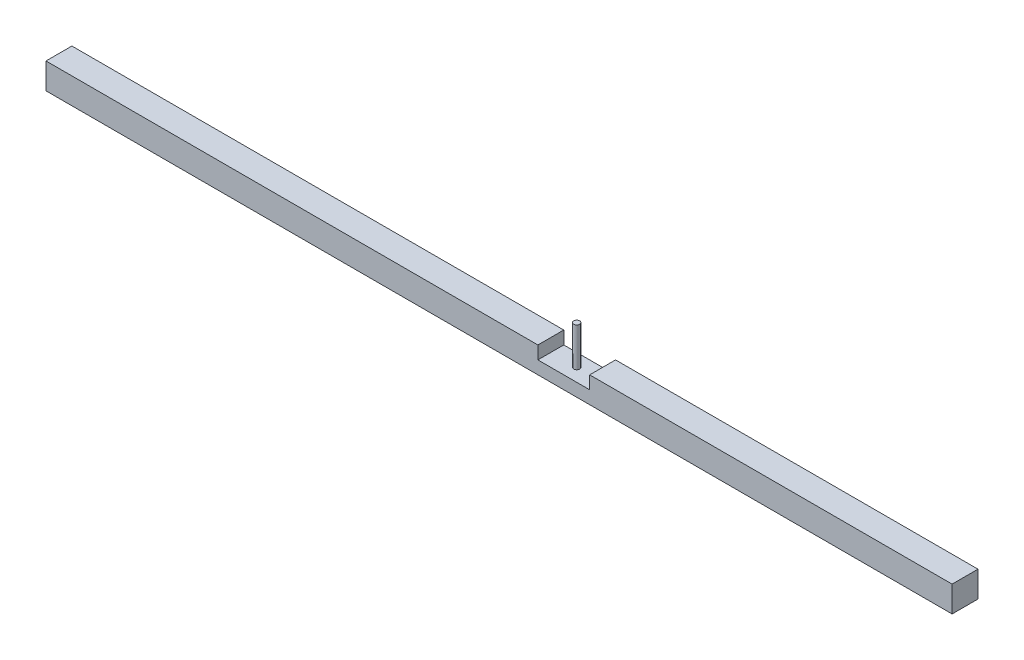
ISO-10303-21;
HEADER;
FILE_DESCRIPTION(('STEP AP214'),'2;1');
FILE_NAME('part.step','',(''),(''),'','','');
FILE_SCHEMA(('AUTOMOTIVE_DESIGN { 1 0 10303 214 1 1 1 1 }'));
ENDSEC;
DATA;
#1=APPLICATION_CONTEXT('core data for automotive mechanical design processes');
#2=APPLICATION_PROTOCOL_DEFINITION('international standard','automotive_design',2000,#1);
#3=PRODUCT_CONTEXT('',#1,'mechanical');
#4=PRODUCT('Part','Part','',(#3));
#5=PRODUCT_RELATED_PRODUCT_CATEGORY('part','',(#4));
#6=PRODUCT_DEFINITION_FORMATION('','',#4);
#7=PRODUCT_DEFINITION_CONTEXT('part definition',#1,'design');
#8=PRODUCT_DEFINITION('design','',#6,#7);
#9=PRODUCT_DEFINITION_SHAPE('','',#8);
#10=(LENGTH_UNIT() NAMED_UNIT(*) SI_UNIT(.MILLI.,.METRE.));
#11=(NAMED_UNIT(*) PLANE_ANGLE_UNIT() SI_UNIT($,.RADIAN.));
#12=(NAMED_UNIT(*) SI_UNIT($,.STERADIAN.) SOLID_ANGLE_UNIT());
#13=UNCERTAINTY_MEASURE_WITH_UNIT(LENGTH_MEASURE(1.E-05),#10,'distance_accuracy_value','');
#14=(GEOMETRIC_REPRESENTATION_CONTEXT(3) GLOBAL_UNCERTAINTY_ASSIGNED_CONTEXT((#13)) GLOBAL_UNIT_ASSIGNED_CONTEXT((#10,
#11,#12)) REPRESENTATION_CONTEXT('',''));
#15=CARTESIAN_POINT('',(0.,0.,0.));
#16=DIRECTION('',(0.,0.,1.));
#17=DIRECTION('',(1.,0.,0.));
#18=AXIS2_PLACEMENT_3D('',#15,#16,#17);
#19=CARTESIAN_POINT('',(25.4,0.,-12.7));
#20=DIRECTION('',(0.,-1.,0.));
#21=DIRECTION('',(0.,0.,-1.));
#22=AXIS2_PLACEMENT_3D('',#19,#20,#21);
#23=PLANE('',#22);
#24=DIRECTION('',(1.,0.,0.));
#25=VECTOR('',#24,1.);
#26=CARTESIAN_POINT('',(25.4,0.,12.7));
#27=LINE('',#26,#25);
#28=CARTESIAN_POINT('',(-25.4,0.,12.7));
#29=VERTEX_POINT('',#28);
#30=CARTESIAN_POINT('',(25.4,0.,12.7));
#31=VERTEX_POINT('',#30);
#32=EDGE_CURVE('E172',#29,#31,#27,.T.);
#33=ORIENTED_EDGE('',*,*,#32,.T.);
#34=DIRECTION('',(0.,0.,1.));
#35=VECTOR('',#34,1.);
#36=CARTESIAN_POINT('',(25.4,0.,-12.7));
#37=LINE('',#36,#35);
#38=CARTESIAN_POINT('',(25.4,0.,-12.7));
#39=VERTEX_POINT('',#38);
#40=EDGE_CURVE('E150',#39,#31,#37,.T.);
#41=ORIENTED_EDGE('',*,*,#40,.F.);
#42=DIRECTION('',(1.,0.,0.));
#43=VECTOR('',#42,1.);
#44=CARTESIAN_POINT('',(25.4,0.,-12.7));
#45=LINE('',#44,#43);
#46=CARTESIAN_POINT('',(-25.4,0.,-12.7));
#47=VERTEX_POINT('',#46);
#48=EDGE_CURVE('E46',#47,#39,#45,.T.);
#49=ORIENTED_EDGE('',*,*,#48,.F.);
#50=DIRECTION('',(0.,0.,1.));
#51=VECTOR('',#50,1.);
#52=CARTESIAN_POINT('',(-25.4,0.,-12.7));
#53=LINE('',#52,#51);
#54=EDGE_CURVE('E102',#47,#29,#53,.T.);
#55=ORIENTED_EDGE('',*,*,#54,.T.);
#56=EDGE_LOOP('',(#33,#41,#49,#55));
#57=FACE_BOUND('',#56,.T.);
#58=CARTESIAN_POINT('',(0.,0.,0.));
#59=DIRECTION('',(0.,-1.,0.));
#60=DIRECTION('',(0.,0.,-1.));
#61=AXIS2_PLACEMENT_3D('',#58,#59,#60);
#62=CIRCLE('',#61,2.921);
#63=CARTESIAN_POINT('',(0.,0.,-2.921));
#64=VERTEX_POINT('',#63);
#65=EDGE_CURVE('E11',#64,#64,#62,.F.);
#66=ORIENTED_EDGE('',*,*,#65,.F.);
#67=EDGE_LOOP('',(#66));
#68=FACE_BOUND('',#67,.T.);
#69=ADVANCED_FACE('F31',(#57,#68),#23,.F.);
#70=CARTESIAN_POINT('',(381.,12.7,12.7));
#71=DIRECTION('',(0.,-1.,0.));
#72=DIRECTION('',(0.,0.,-1.));
#73=AXIS2_PLACEMENT_3D('',#70,#71,#72);
#74=PLANE('',#73);
#75=DIRECTION('',(-1.,0.,0.));
#76=VECTOR('',#75,1.);
#77=CARTESIAN_POINT('',(381.,12.7,-12.7));
#78=LINE('',#77,#76);
#79=CARTESIAN_POINT('',(381.,12.7,-12.7));
#80=VERTEX_POINT('',#79);
#81=CARTESIAN_POINT('',(25.4,12.7,-12.7));
#82=VERTEX_POINT('',#81);
#83=EDGE_CURVE('E119',#80,#82,#78,.T.);
#84=ORIENTED_EDGE('',*,*,#83,.T.);
#85=DIRECTION('',(0.,0.,1.));
#86=VECTOR('',#85,1.);
#87=CARTESIAN_POINT('',(25.4,12.7,-12.7));
#88=LINE('',#87,#86);
#89=CARTESIAN_POINT('',(25.4,12.7,12.7));
#90=VERTEX_POINT('',#89);
#91=EDGE_CURVE('E147',#82,#90,#88,.T.);
#92=ORIENTED_EDGE('',*,*,#91,.T.);
#93=DIRECTION('',(-1.,0.,0.));
#94=VECTOR('',#93,1.);
#95=CARTESIAN_POINT('',(381.,12.7,12.7));
#96=LINE('',#95,#94);
#97=CARTESIAN_POINT('',(381.,12.7,12.7));
#98=VERTEX_POINT('',#97);
#99=EDGE_CURVE('E39',#98,#90,#96,.T.);
#100=ORIENTED_EDGE('',*,*,#99,.F.);
#101=DIRECTION('',(0.,0.,1.));
#102=VECTOR('',#101,1.);
#103=CARTESIAN_POINT('',(381.,12.7,12.7));
#104=LINE('',#103,#102);
#105=EDGE_CURVE('E156',#80,#98,#104,.T.);
#106=ORIENTED_EDGE('',*,*,#105,.F.);
#107=EDGE_LOOP('',(#84,#92,#100,#106));
#108=FACE_BOUND('',#107,.T.);
#109=ADVANCED_FACE('F168',(#108),#74,.F.);
#110=CARTESIAN_POINT('',(-25.4,12.7,12.7));
#111=VERTEX_POINT('',#110);
#112=CARTESIAN_POINT('',(-508.,12.7,12.7));
#113=VERTEX_POINT('',#112);
#114=EDGE_CURVE('E112',#111,#113,#96,.T.);
#115=ORIENTED_EDGE('',*,*,#114,.F.);
#116=DIRECTION('',(0.,0.,1.));
#117=VECTOR('',#116,1.);
#118=CARTESIAN_POINT('',(-25.4,12.7,-12.7));
#119=LINE('',#118,#117);
#120=CARTESIAN_POINT('',(-25.4,12.7,-12.7));
#121=VERTEX_POINT('',#120);
#122=EDGE_CURVE('E100',#121,#111,#119,.T.);
#123=ORIENTED_EDGE('',*,*,#122,.F.);
#124=CARTESIAN_POINT('',(-508.,12.7,-12.7));
#125=VERTEX_POINT('',#124);
#126=EDGE_CURVE('E110',#121,#125,#78,.T.);
#127=ORIENTED_EDGE('',*,*,#126,.T.);
#128=DIRECTION('',(0.,0.,1.));
#129=VECTOR('',#128,1.);
#130=CARTESIAN_POINT('',(-508.,12.7,12.7));
#131=LINE('',#130,#129);
#132=EDGE_CURVE('E143',#125,#113,#131,.T.);
#133=ORIENTED_EDGE('',*,*,#132,.T.);
#134=EDGE_LOOP('',(#115,#123,#127,#133));
#135=FACE_BOUND('',#134,.T.);
#136=ADVANCED_FACE('F33',(#135),#74,.F.);
#137=CARTESIAN_POINT('',(381.,-12.7,12.7));
#138=DIRECTION('',(0.,0.,-1.));
#139=DIRECTION('',(-1.,0.,0.));
#140=AXIS2_PLACEMENT_3D('',#137,#138,#139);
#141=PLANE('',#140);
#142=ORIENTED_EDGE('',*,*,#99,.T.);
#143=DIRECTION('',(0.,1.,0.));
#144=VECTOR('',#143,1.);
#145=CARTESIAN_POINT('',(25.4,12.7,12.7));
#146=LINE('',#145,#144);
#147=EDGE_CURVE('E105',#31,#90,#146,.T.);
#148=ORIENTED_EDGE('',*,*,#147,.F.);
#149=ORIENTED_EDGE('',*,*,#32,.F.);
#150=DIRECTION('',(0.,-1.,0.));
#151=VECTOR('',#150,1.);
#152=CARTESIAN_POINT('',(-25.4,0.,12.7));
#153=LINE('',#152,#151);
#154=EDGE_CURVE('E139',#111,#29,#153,.T.);
#155=ORIENTED_EDGE('',*,*,#154,.F.);
#156=ORIENTED_EDGE('',*,*,#114,.T.);
#157=DIRECTION('',(0.,-1.,0.));
#158=VECTOR('',#157,1.);
#159=CARTESIAN_POINT('',(-508.,-12.7,12.7));
#160=LINE('',#159,#158);
#161=CARTESIAN_POINT('',(-508.,-12.7,12.7));
#162=VERTEX_POINT('',#161);
#163=EDGE_CURVE('E137',#113,#162,#160,.T.);
#164=ORIENTED_EDGE('',*,*,#163,.T.);
#165=DIRECTION('',(-1.,0.,0.));
#166=VECTOR('',#165,1.);
#167=CARTESIAN_POINT('',(381.,-12.7,12.7));
#168=LINE('',#167,#166);
#169=CARTESIAN_POINT('',(381.,-12.7,12.7));
#170=VERTEX_POINT('',#169);
#171=EDGE_CURVE('E128',#170,#162,#168,.T.);
#172=ORIENTED_EDGE('',*,*,#171,.F.);
#173=DIRECTION('',(0.,-1.,0.));
#174=VECTOR('',#173,1.);
#175=CARTESIAN_POINT('',(381.,-12.7,12.7));
#176=LINE('',#175,#174);
#177=EDGE_CURVE('E158',#98,#170,#176,.T.);
#178=ORIENTED_EDGE('',*,*,#177,.F.);
#179=EDGE_LOOP('',(#142,#148,#149,#155,#156,#164,#172,#178));
#180=FACE_BOUND('',#179,.T.);
#181=ADVANCED_FACE('F135',(#180),#141,.F.);
#182=CARTESIAN_POINT('',(381.,-12.7,-12.7));
#183=DIRECTION('',(0.,1.,0.));
#184=DIRECTION('',(0.,0.,1.));
#185=AXIS2_PLACEMENT_3D('',#182,#183,#184);
#186=PLANE('',#185);
#187=ORIENTED_EDGE('',*,*,#171,.T.);
#188=DIRECTION('',(0.,0.,-1.));
#189=VECTOR('',#188,1.);
#190=CARTESIAN_POINT('',(-508.,-12.7,-12.7));
#191=LINE('',#190,#189);
#192=CARTESIAN_POINT('',(-508.,-12.7,-12.7));
#193=VERTEX_POINT('',#192);
#194=EDGE_CURVE('E145',#162,#193,#191,.T.);
#195=ORIENTED_EDGE('',*,*,#194,.T.);
#196=DIRECTION('',(-1.,0.,0.));
#197=VECTOR('',#196,1.);
#198=CARTESIAN_POINT('',(381.,-12.7,-12.7));
#199=LINE('',#198,#197);
#200=CARTESIAN_POINT('',(381.,-12.7,-12.7));
#201=VERTEX_POINT('',#200);
#202=EDGE_CURVE('E122',#201,#193,#199,.T.);
#203=ORIENTED_EDGE('',*,*,#202,.F.);
#204=DIRECTION('',(0.,0.,-1.));
#205=VECTOR('',#204,1.);
#206=CARTESIAN_POINT('',(381.,-12.7,-12.7));
#207=LINE('',#206,#205);
#208=EDGE_CURVE('E123',#170,#201,#207,.T.);
#209=ORIENTED_EDGE('',*,*,#208,.F.);
#210=EDGE_LOOP('',(#187,#195,#203,#209));
#211=FACE_BOUND('',#210,.T.);
#212=ADVANCED_FACE('F163',(#211),#186,.F.);
#213=CARTESIAN_POINT('',(381.,12.7,-12.7));
#214=DIRECTION('',(0.,0.,1.));
#215=DIRECTION('',(1.,0.,0.));
#216=AXIS2_PLACEMENT_3D('',#213,#214,#215);
#217=PLANE('',#216);
#218=ORIENTED_EDGE('',*,*,#48,.T.);
#219=DIRECTION('',(0.,1.,0.));
#220=VECTOR('',#219,1.);
#221=CARTESIAN_POINT('',(25.4,12.7,-12.7));
#222=LINE('',#221,#220);
#223=EDGE_CURVE('E113',#39,#82,#222,.T.);
#224=ORIENTED_EDGE('',*,*,#223,.T.);
#225=ORIENTED_EDGE('',*,*,#83,.F.);
#226=DIRECTION('',(0.,1.,0.));
#227=VECTOR('',#226,1.);
#228=CARTESIAN_POINT('',(381.,12.7,-12.7));
#229=LINE('',#228,#227);
#230=EDGE_CURVE('E54',#201,#80,#229,.T.);
#231=ORIENTED_EDGE('',*,*,#230,.F.);
#232=ORIENTED_EDGE('',*,*,#202,.T.);
#233=DIRECTION('',(0.,1.,0.));
#234=VECTOR('',#233,1.);
#235=CARTESIAN_POINT('',(-508.,12.7,-12.7));
#236=LINE('',#235,#234);
#237=EDGE_CURVE('E118',#193,#125,#236,.T.);
#238=ORIENTED_EDGE('',*,*,#237,.T.);
#239=ORIENTED_EDGE('',*,*,#126,.F.);
#240=DIRECTION('',(0.,-1.,0.));
#241=VECTOR('',#240,1.);
#242=CARTESIAN_POINT('',(-25.4,0.,-12.7));
#243=LINE('',#242,#241);
#244=EDGE_CURVE('E96',#121,#47,#243,.T.);
#245=ORIENTED_EDGE('',*,*,#244,.T.);
#246=EDGE_LOOP('',(#218,#224,#225,#231,#232,#238,#239,#245));
#247=FACE_BOUND('',#246,.T.);
#248=ADVANCED_FACE('F116',(#247),#217,.F.);
#249=CARTESIAN_POINT('',(381.,12.7,-12.7));
#250=DIRECTION('',(-1.,0.,0.));
#251=DIRECTION('',(0.,0.,1.));
#252=AXIS2_PLACEMENT_3D('',#249,#250,#251);
#253=PLANE('',#252);
#254=ORIENTED_EDGE('',*,*,#105,.T.);
#255=ORIENTED_EDGE('',*,*,#177,.T.);
#256=ORIENTED_EDGE('',*,*,#208,.T.);
#257=ORIENTED_EDGE('',*,*,#230,.T.);
#258=EDGE_LOOP('',(#254,#255,#256,#257));
#259=FACE_BOUND('',#258,.T.);
#260=ADVANCED_FACE('F161',(#259),#253,.F.);
#261=CARTESIAN_POINT('',(-508.,12.7,-12.7));
#262=DIRECTION('',(-1.,0.,0.));
#263=DIRECTION('',(0.,0.,1.));
#264=AXIS2_PLACEMENT_3D('',#261,#262,#263);
#265=PLANE('',#264);
#266=ORIENTED_EDGE('',*,*,#132,.F.);
#267=ORIENTED_EDGE('',*,*,#237,.F.);
#268=ORIENTED_EDGE('',*,*,#194,.F.);
#269=ORIENTED_EDGE('',*,*,#163,.F.);
#270=EDGE_LOOP('',(#266,#267,#268,#269));
#271=FACE_BOUND('',#270,.T.);
#272=ADVANCED_FACE('F142',(#271),#265,.T.);
#273=CARTESIAN_POINT('',(25.4,12.7,-12.7));
#274=DIRECTION('',(1.,0.,0.));
#275=DIRECTION('',(0.,0.,-1.));
#276=AXIS2_PLACEMENT_3D('',#273,#274,#275);
#277=PLANE('',#276);
#278=ORIENTED_EDGE('',*,*,#147,.T.);
#279=ORIENTED_EDGE('',*,*,#91,.F.);
#280=ORIENTED_EDGE('',*,*,#223,.F.);
#281=ORIENTED_EDGE('',*,*,#40,.T.);
#282=EDGE_LOOP('',(#278,#279,#280,#281));
#283=FACE_BOUND('',#282,.T.);
#284=ADVANCED_FACE('F170',(#283),#277,.F.);
#285=CARTESIAN_POINT('',(-25.4,0.,-12.7));
#286=DIRECTION('',(-1.,0.,0.));
#287=DIRECTION('',(0.,0.,1.));
#288=AXIS2_PLACEMENT_3D('',#285,#286,#287);
#289=PLANE('',#288);
#290=ORIENTED_EDGE('',*,*,#154,.T.);
#291=ORIENTED_EDGE('',*,*,#54,.F.);
#292=ORIENTED_EDGE('',*,*,#244,.F.);
#293=ORIENTED_EDGE('',*,*,#122,.T.);
#294=EDGE_LOOP('',(#290,#291,#292,#293));
#295=FACE_BOUND('',#294,.T.);
#296=ADVANCED_FACE('F99',(#295),#289,.F.);
#297=CARTESIAN_POINT('',(0.,38.1,0.));
#298=DIRECTION('',(0.,-1.,0.));
#299=DIRECTION('',(0.,0.,-1.));
#300=AXIS2_PLACEMENT_3D('',#297,#298,#299);
#301=CYLINDRICAL_SURFACE('',#300,2.921);
#302=CARTESIAN_POINT('',(0.,38.1,0.));
#303=DIRECTION('',(0.,1.,0.));
#304=DIRECTION('',(0.,0.,1.));
#305=AXIS2_PLACEMENT_3D('',#302,#303,#304);
#306=CIRCLE('',#305,2.921);
#307=CARTESIAN_POINT('',(0.,38.1,2.921));
#308=VERTEX_POINT('',#307);
#309=EDGE_CURVE('E178',#308,#308,#306,.T.);
#310=ORIENTED_EDGE('',*,*,#309,.F.);
#311=EDGE_LOOP('',(#310));
#312=FACE_BOUND('',#311,.T.);
#313=ORIENTED_EDGE('',*,*,#65,.T.);
#314=EDGE_LOOP('',(#313));
#315=FACE_BOUND('',#314,.T.);
#316=ADVANCED_FACE('F187',(#312,#315),#301,.T.);
#317=CARTESIAN_POINT('',(0.,38.1,0.));
#318=DIRECTION('',(0.,1.,0.));
#319=DIRECTION('',(0.,0.,1.));
#320=AXIS2_PLACEMENT_3D('',#317,#318,#319);
#321=PLANE('',#320);
#322=ORIENTED_EDGE('',*,*,#309,.T.);
#323=EDGE_LOOP('',(#322));
#324=FACE_BOUND('',#323,.T.);
#325=ADVANCED_FACE('F185',(#324),#321,.T.);
#326=CLOSED_SHELL('',(#69,#109,#136,#181,#212,#248,#260,#272,#284,#296,#316,#325));
#327=MANIFOLD_SOLID_BREP('B2',#326);
#328=ADVANCED_BREP_SHAPE_REPRESENTATION('',(#18,#327),#14);
#329=SHAPE_DEFINITION_REPRESENTATION(#9,#328);
ENDSEC;
END-ISO-10303-21;
